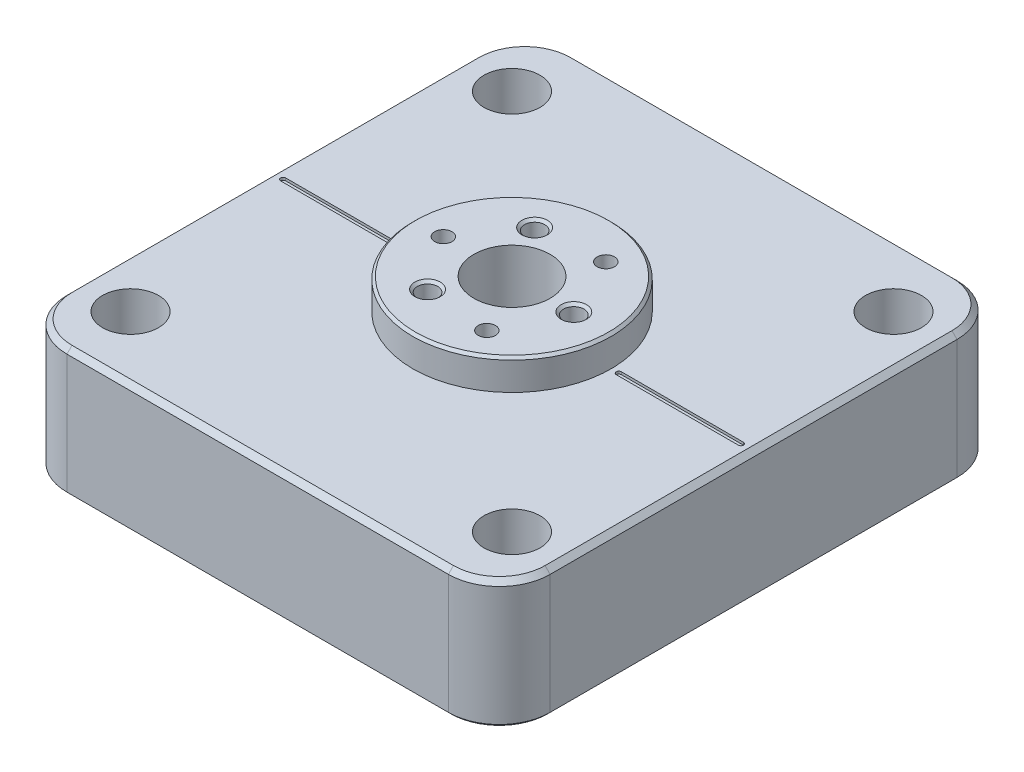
from build123d import *

# Parameters (mm, degrees)
SKETCH1_W                   = 95
SKETCH1_H                   = 100
EXTRUDE1_DEPTH              = 25
FILLET1_R                   = 10
SKETCH2_R                   = 19.5
EXTRUDE2_DEPTH              = 6
HOLE_WIZARD_2_D             = 6.6
HOLE_WIZARD_2_DEPTH         = 30
HOLE_WIZARD_2_CBORE_D       = 11
HOLE_WIZARD_2_CBORE_DEPTH   = 17
HOLE_WIZARD_2_TIP           = 1.982840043
CHAMFER12_SIZE              = 1
SKETCH34_W                  = 65
SKETCH34_H                  = 70
EXTRUDE20_DEPTH             = 17
FILLET12_R                  = 10
HOLE_WIZARD_2_2_D           = 3.4
HOLE_WIZARD_2_2_CBORE_D     = 6
HOLE_WIZARD_2_2_CBORE_DEPTH = 9
PATTERN_CIRCULAR_1_COUNT    = 3
CUT_EXTRUDE_1_DEPTH         = 0.5
SKETCH_4_R                  = 7.5
CUT_EXTRUDE_2_DEPTH         = 72.029923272
CHAMFER_2_SIZE              = 0.5
CHAMFER_3_SIZE              = 0.5
SKETCH_6_R                  = 2
CUT_EXTRUDE_3_DEPTH         = 6
PATTERN_CIRCULAR_2_COUNT    = 3
CHAMFER_4_SIZE              = 0.5
CHAMFER_5_SIZE              = 0.5


with BuildPart() as part:
    # Sketch1 → Extrude1 (new body)
    with BuildSketch(Plane(origin=(0, 0, 0), x_dir=(1, 0, 0), z_dir=(0, 1, 0))):
        Rectangle(SKETCH1_W, SKETCH1_H)
    extrude(amount=EXTRUDE1_DEPTH)

    # Fillet1
    fillet1_edges = [part.edges().sort_by_distance(p)[0] for p in [
        (47.5, 12.5, 50),
        (-47.5, 12.5, 50),
        (-47.5, 12.5, -50),
        (47.5, 12.5, -50),
    ]]
    fillet(fillet1_edges, radius=FILLET1_R)

    # Sketch2 → Extrude2 (add)
    with BuildSketch(Plane(origin=(0, 25, 0), x_dir=(1, 0, 0), z_dir=(0, 1, 0))):
        with Locations(Location((0, 0, 0), (0, 0, 270))):
            Circle(SKETCH2_R)
    extrude(amount=EXTRUDE2_DEPTH)

    # Hole Wizard 2
    with Locations(Plane(origin=(37.5, 25, -37.5), x_dir=(0, 0, 1), z_dir=(0, 1, 0))):
        with Locations((0, 0), (75, 0), (75, -75), (0, -75)):
            CounterBoreHole(HOLE_WIZARD_2_D / 2, HOLE_WIZARD_2_CBORE_D / 2, HOLE_WIZARD_2_CBORE_DEPTH, depth=HOLE_WIZARD_2_DEPTH)
            with Locations((0, 0, -(HOLE_WIZARD_2_DEPTH + HOLE_WIZARD_2_TIP / 2))):  # 118° drill point
                Cone(0, HOLE_WIZARD_2_D / 2, HOLE_WIZARD_2_TIP, mode=Mode.SUBTRACT)

    # Chamfer12
    chamfer12_edges = [part.edges().sort_by_distance(p)[0] for p in [
        (47.5, 25, 0),
        (0, 25, 50),
        (0, 25, -50),
        (-47.5, 25, 0),
        (-44.571067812, 25, 47.071067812),
        (44.571067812, 25, -47.071067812),
        (-44.571067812, 25, -47.071067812),
        (44.571067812, 25, 47.071067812),
    ]]
    chamfer(chamfer12_edges, length=CHAMFER12_SIZE)

    # Sketch34 → Extrude20 (cut)
    with BuildSketch(Plane(origin=(0, 0, 0), x_dir=(-1, 0, 0), z_dir=(0, -1, 0))):
        Rectangle(SKETCH34_W, SKETCH34_H)
    extrude(amount=-EXTRUDE20_DEPTH, mode=Mode.SUBTRACT)

    # Fillet12
    fillet12_edges = [part.edges().sort_by_distance(p)[0] for p in [
        (32.5, 8.5, 35),
        (32.5, 8.5, -35),
        (-32.5, 8.5, -35),
        (-32.5, 8.5, 35),
    ]]
    fillet(fillet12_edges, radius=FILLET12_R)

    # Hole Wizard 2 2 (through all)
    with Locations(Plane(origin=(-13.5, 17, 0), x_dir=(0, 0, -1), z_dir=(0, -1, 0))):
        with Locations((0, 0)):
            hole_wizard_2_2 = CounterBoreHole(HOLE_WIZARD_2_2_D / 2, HOLE_WIZARD_2_2_CBORE_D / 2, HOLE_WIZARD_2_2_CBORE_DEPTH)

    # Pattern Circular 1: Hole Wizard 2 2 ×3 about axis
    pattern_circular_1_axis = Axis((0, 0, 0), (0, 1, 0))
    for i in range(1, PATTERN_CIRCULAR_1_COUNT):
        add(hole_wizard_2_2.rotate(pattern_circular_1_axis, i * 360 / PATTERN_CIRCULAR_1_COUNT), mode=Mode.SUBTRACT)

    # Sketch 3 → Cut-Extrude 1 (cut)
    with BuildSketch(Plane(origin=(0, 25, 0), x_dir=(1, 0, 0), z_dir=(0, 1, 0))):
        with BuildLine():
            Line((-45, 0.5), (-21, 0.5))
            ThreePointArc((-21, 0.5), (-20.5, 0), (-21, -0.5))
            Line((-21, -0.5), (-45, -0.5))
            ThreePointArc((-45, -0.5), (-45.5, 0), (-45, 0.5))
        make_face()
    cut_extrude_1 = extrude(amount=-CUT_EXTRUDE_1_DEPTH, mode=Mode.SUBTRACT)

    # Mirror 1: Cut-Extrude 1 across plane
    add(cut_extrude_1.mirror(Plane(origin=(0, 0, 0), x_dir=(0, 0, 1), z_dir=(1, 0, 0))), mode=Mode.SUBTRACT)

    # Sketch 4 → Cut-Extrude 2 (cut, through all)
    with BuildSketch(Plane(origin=(0, 17, 0), x_dir=(-1, 0, 0), z_dir=(0, -1, 0))):
        with Locations(Location((0, 0, 0), (0, 0, 90))):
            Circle(SKETCH_4_R)
    extrude(amount=-CUT_EXTRUDE_2_DEPTH, mode=Mode.SUBTRACT)

    # Chamfer 2
    chamfer_2_edges = [part.edges().sort_by_distance(p)[0] for p in [
        (0, 0, -35),
        (-32.5, 0, 0),
        (0, 0, 35),
        (32.5, 0, 0),
        (-29.571067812, 0, -32.071067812),
        (-29.571067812, 0, 32.071067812),
        (29.571067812, 0, 32.071067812),
        (29.571067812, 0, -32.071067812),
    ]]
    chamfer(chamfer_2_edges, length=CHAMFER_2_SIZE)

    # Chamfer 3
    chamfer_3_edges = [part.edges().sort_by_distance(p)[0] for p in [
        (47.5, 0, 0),
        (0, 0, 50),
        (-47.5, 0, 0),
        (0, 0, -50),
        (-44.571067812, 0, 47.071067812),
        (44.571067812, 0, -47.071067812),
        (-44.571067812, 0, -47.071067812),
        (44.571067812, 0, 47.071067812),
    ]]
    chamfer(chamfer_3_edges, length=CHAMFER_3_SIZE)

    # Sketch 6 → Cut-Extrude 3 (cut)
    with BuildSketch(Plane(origin=(0, 31, 0), x_dir=(1, 0, 0), z_dir=(0, 1, 0))):
        with Locations(Location((12.15, 0, 0), (0, 0, 270))):
            Circle(SKETCH_6_R)
    cut_extrude_3 = extrude(amount=-CUT_EXTRUDE_3_DEPTH, mode=Mode.SUBTRACT)

    # Pattern Circular 2: Cut-Extrude 3 ×3 about axis
    pattern_circular_2_axis = Axis((0, 0, 0), (0, 1, 0))
    for i in range(1, PATTERN_CIRCULAR_2_COUNT):
        add(cut_extrude_3.rotate(pattern_circular_2_axis, i * 360 / PATTERN_CIRCULAR_2_COUNT), mode=Mode.SUBTRACT)

    # Chamfer 4
    chamfer_4_edges = [part.edges().sort_by_distance(p)[0] for p in [
        (12.15, 31, -2),
        (-4.342949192, 31, 11.522208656),
        (-7.807050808, 31, -9.522208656),
    ]]
    chamfer(chamfer_4_edges, length=CHAMFER_4_SIZE)

    # Chamfer 5
    chamfer_5_edges = [part.edges().sort_by_distance(p)[0] for p in [
        (0, 31, -19.5),
    ]]
    chamfer(chamfer_5_edges, length=CHAMFER_5_SIZE)


solid = part.part
